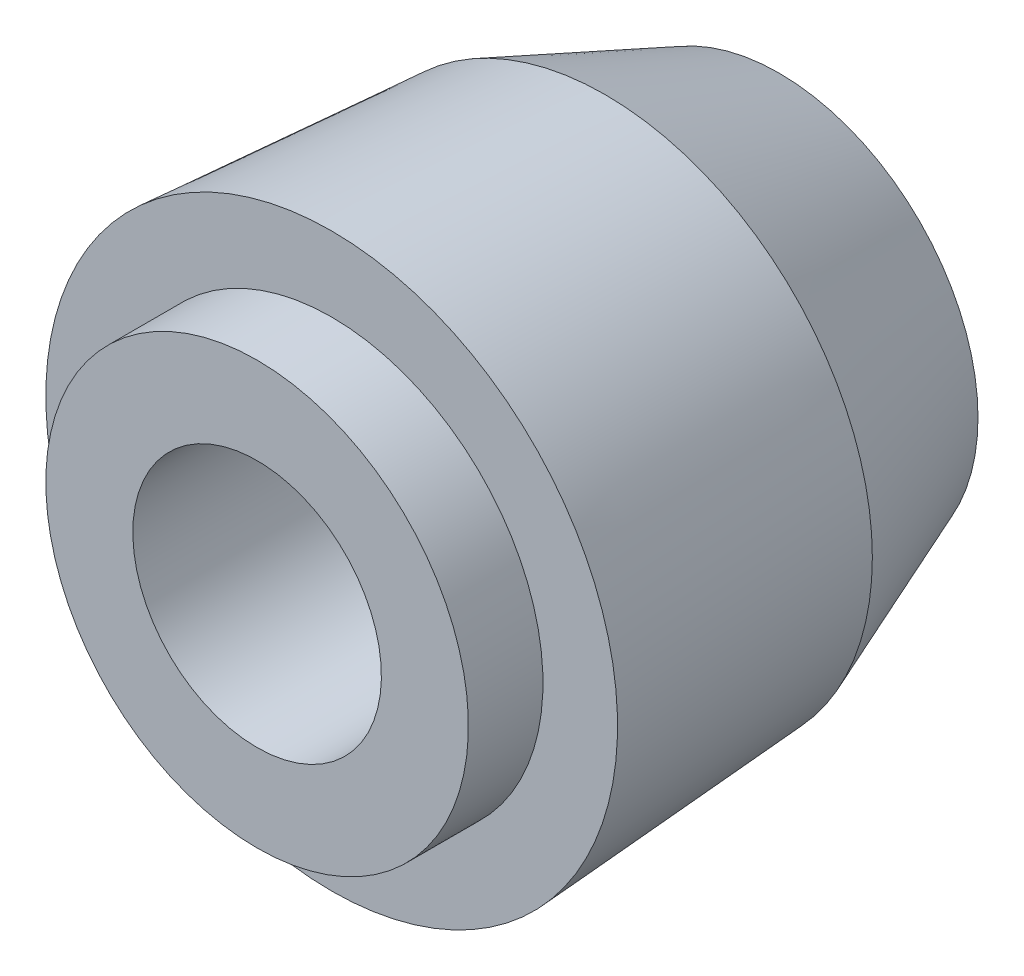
ISO-10303-21;
HEADER;
FILE_DESCRIPTION(('STEP AP214'),'2;1');
FILE_NAME('part.step','',(''),(''),'','','');
FILE_SCHEMA(('AUTOMOTIVE_DESIGN { 1 0 10303 214 1 1 1 1 }'));
ENDSEC;
DATA;
#1=APPLICATION_CONTEXT('core data for automotive mechanical design processes');
#2=APPLICATION_PROTOCOL_DEFINITION('international standard','automotive_design',2000,#1);
#3=PRODUCT_CONTEXT('',#1,'mechanical');
#4=PRODUCT('Part','Part','',(#3));
#5=PRODUCT_RELATED_PRODUCT_CATEGORY('part','',(#4));
#6=PRODUCT_DEFINITION_FORMATION('','',#4);
#7=PRODUCT_DEFINITION_CONTEXT('part definition',#1,'design');
#8=PRODUCT_DEFINITION('design','',#6,#7);
#9=PRODUCT_DEFINITION_SHAPE('','',#8);
#10=(LENGTH_UNIT() NAMED_UNIT(*) SI_UNIT(.MILLI.,.METRE.));
#11=(NAMED_UNIT(*) PLANE_ANGLE_UNIT() SI_UNIT($,.RADIAN.));
#12=(NAMED_UNIT(*) SI_UNIT($,.STERADIAN.) SOLID_ANGLE_UNIT());
#13=UNCERTAINTY_MEASURE_WITH_UNIT(LENGTH_MEASURE(1.E-05),#10,'distance_accuracy_value','');
#14=(GEOMETRIC_REPRESENTATION_CONTEXT(3) GLOBAL_UNCERTAINTY_ASSIGNED_CONTEXT((#13)) GLOBAL_UNIT_ASSIGNED_CONTEXT((#10,
#11,#12)) REPRESENTATION_CONTEXT('',''));
#15=CARTESIAN_POINT('',(0.,0.,0.));
#16=DIRECTION('',(0.,0.,1.));
#17=DIRECTION('',(1.,0.,0.));
#18=AXIS2_PLACEMENT_3D('',#15,#16,#17);
#19=CARTESIAN_POINT('',(5.,0.,21.));
#20=DIRECTION('',(0.,0.,-1.));
#21=DIRECTION('',(0.,1.,0.));
#22=AXIS2_PLACEMENT_3D('',#19,#20,#21);
#23=PLANE('',#22);
#24=CARTESIAN_POINT('',(0.,0.,21.));
#25=DIRECTION('',(0.,0.,1.));
#26=DIRECTION('',(0.,-1.,0.));
#27=AXIS2_PLACEMENT_3D('',#24,#25,#26);
#28=CIRCLE('',#27,5.0000000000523);
#29=CARTESIAN_POINT('',(0.,-5.0000000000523,21.));
#30=VERTEX_POINT('',#29);
#31=EDGE_CURVE('E39',#30,#30,#28,.T.);
#32=ORIENTED_EDGE('',*,*,#31,.F.);
#33=EDGE_LOOP('',(#32));
#34=FACE_BOUND('',#33,.T.);
#35=CARTESIAN_POINT('',(0.,0.,21.));
#36=DIRECTION('',(0.,0.,1.));
#37=DIRECTION('',(0.,-1.,0.));
#38=AXIS2_PLACEMENT_3D('',#35,#36,#37);
#39=CIRCLE('',#38,8.5);
#40=CARTESIAN_POINT('',(0.,-8.5,21.));
#41=VERTEX_POINT('',#40);
#42=EDGE_CURVE('E15',#41,#41,#39,.F.);
#43=ORIENTED_EDGE('',*,*,#42,.F.);
#44=EDGE_LOOP('',(#43));
#45=FACE_BOUND('',#44,.T.);
#46=ADVANCED_FACE('F12',(#34,#45),#23,.F.);
#47=CARTESIAN_POINT('',(8.,0.,0.));
#48=DIRECTION('',(0.,0.,1.));
#49=DIRECTION('',(0.,-1.,0.));
#50=AXIS2_PLACEMENT_3D('',#47,#48,#49);
#51=PLANE('',#50);
#52=CARTESIAN_POINT('',(0.,0.,0.));
#53=DIRECTION('',(0.,0.,1.));
#54=DIRECTION('',(-1.,0.,0.));
#55=AXIS2_PLACEMENT_3D('',#52,#53,#54);
#56=CIRCLE('',#55,8.);
#57=CARTESIAN_POINT('',(-8.,0.,0.));
#58=VERTEX_POINT('',#57);
#59=EDGE_CURVE('E30',#58,#58,#56,.T.);
#60=ORIENTED_EDGE('',*,*,#59,.F.);
#61=EDGE_LOOP('',(#60));
#62=FACE_BOUND('',#61,.T.);
#63=ADVANCED_FACE('F51',(#62),#51,.F.);
#64=CARTESIAN_POINT('',(0.,0.,0.));
#65=DIRECTION('',(0.,0.,1.));
#66=DIRECTION('',(0.,-1.,0.));
#67=AXIS2_PLACEMENT_3D('',#64,#65,#66);
#68=CYLINDRICAL_SURFACE('',#67,8.5);
#69=ORIENTED_EDGE('',*,*,#42,.T.);
#70=EDGE_LOOP('',(#69));
#71=FACE_BOUND('',#70,.T.);
#72=CARTESIAN_POINT('',(0.,0.,18.));
#73=DIRECTION('',(0.,0.,1.));
#74=DIRECTION('',(0.,-1.,0.));
#75=AXIS2_PLACEMENT_3D('',#72,#73,#74);
#76=CIRCLE('',#75,8.5);
#77=CARTESIAN_POINT('',(0.,-8.5,18.));
#78=VERTEX_POINT('',#77);
#79=EDGE_CURVE('E24',#78,#78,#76,.T.);
#80=ORIENTED_EDGE('',*,*,#79,.T.);
#81=EDGE_LOOP('',(#80));
#82=FACE_BOUND('',#81,.T.);
#83=ADVANCED_FACE('F57',(#71,#82),#68,.T.);
#84=CARTESIAN_POINT('',(0.,0.,7.));
#85=DIRECTION('',(0.,0.,1.));
#86=DIRECTION('',(-1.,0.,0.));
#87=AXIS2_PLACEMENT_3D('',#84,#85,#86);
#88=CONICAL_SURFACE('',#87,10.75,0.374333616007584);
#89=CARTESIAN_POINT('',(0.,0.,7.));
#90=DIRECTION('',(0.,0.,1.));
#91=DIRECTION('',(0.,-1.,0.));
#92=AXIS2_PLACEMENT_3D('',#89,#90,#91);
#93=CIRCLE('',#92,10.75);
#94=CARTESIAN_POINT('',(0.,-10.75,7.));
#95=VERTEX_POINT('',#94);
#96=EDGE_CURVE('E19',#95,#95,#93,.T.);
#97=ORIENTED_EDGE('',*,*,#96,.F.);
#98=EDGE_LOOP('',(#97));
#99=FACE_BOUND('',#98,.T.);
#100=ORIENTED_EDGE('',*,*,#59,.T.);
#101=EDGE_LOOP('',(#100));
#102=FACE_BOUND('',#101,.T.);
#103=ADVANCED_FACE('F68',(#99,#102),#88,.T.);
#104=CARTESIAN_POINT('',(8.5,0.,18.));
#105=DIRECTION('',(0.,0.,-1.));
#106=DIRECTION('',(0.,1.,0.));
#107=AXIS2_PLACEMENT_3D('',#104,#105,#106);
#108=PLANE('',#107);
#109=ORIENTED_EDGE('',*,*,#79,.F.);
#110=EDGE_LOOP('',(#109));
#111=FACE_BOUND('',#110,.T.);
#112=CARTESIAN_POINT('',(0.,0.,18.));
#113=DIRECTION('',(0.,0.,1.));
#114=DIRECTION('',(0.,-1.,0.));
#115=AXIS2_PLACEMENT_3D('',#112,#113,#114);
#116=CIRCLE('',#115,11.5);
#117=CARTESIAN_POINT('',(0.,-11.5,18.));
#118=VERTEX_POINT('',#117);
#119=EDGE_CURVE('E8',#118,#118,#116,.F.);
#120=ORIENTED_EDGE('',*,*,#119,.F.);
#121=EDGE_LOOP('',(#120));
#122=FACE_BOUND('',#121,.T.);
#123=ADVANCED_FACE('F63',(#111,#122),#108,.F.);
#124=CARTESIAN_POINT('',(0.,0.,18.));
#125=DIRECTION('',(0.,0.,1.));
#126=DIRECTION('',(0.,-1.,0.));
#127=AXIS2_PLACEMENT_3D('',#124,#125,#126);
#128=CONICAL_SURFACE('',#127,11.5,0.0680764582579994);
#129=ORIENTED_EDGE('',*,*,#119,.T.);
#130=EDGE_LOOP('',(#129));
#131=FACE_BOUND('',#130,.T.);
#132=ORIENTED_EDGE('',*,*,#96,.T.);
#133=EDGE_LOOP('',(#132));
#134=FACE_BOUND('',#133,.T.);
#135=ADVANCED_FACE('F60',(#131,#134),#128,.T.);
#136=CARTESIAN_POINT('',(0.,0.,13.));
#137=DIRECTION('',(0.,0.,1.));
#138=DIRECTION('',(0.,-1.,0.));
#139=AXIS2_PLACEMENT_3D('',#136,#137,#138);
#140=PLANE('',#139);
#141=CARTESIAN_POINT('',(0.,0.,13.));
#142=DIRECTION('',(0.,0.,1.));
#143=DIRECTION('',(0.,-1.,0.));
#144=AXIS2_PLACEMENT_3D('',#141,#142,#143);
#145=CIRCLE('',#144,5.0000000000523);
#146=CARTESIAN_POINT('',(0.,-5.0000000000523,13.));
#147=VERTEX_POINT('',#146);
#148=EDGE_CURVE('E35',#147,#147,#145,.T.);
#149=ORIENTED_EDGE('',*,*,#148,.T.);
#150=EDGE_LOOP('',(#149));
#151=FACE_BOUND('',#150,.T.);
#152=ADVANCED_FACE('F52',(#151),#140,.T.);
#153=CARTESIAN_POINT('',(0.,0.,13.));
#154=DIRECTION('',(0.,0.,1.));
#155=DIRECTION('',(0.,-1.,0.));
#156=AXIS2_PLACEMENT_3D('',#153,#154,#155);
#157=CYLINDRICAL_SURFACE('',#156,5.0000000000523);
#158=ORIENTED_EDGE('',*,*,#148,.F.);
#159=EDGE_LOOP('',(#158));
#160=FACE_BOUND('',#159,.T.);
#161=ORIENTED_EDGE('',*,*,#31,.T.);
#162=EDGE_LOOP('',(#161));
#163=FACE_BOUND('',#162,.T.);
#164=ADVANCED_FACE('F47',(#160,#163),#157,.F.);
#165=CLOSED_SHELL('',(#46,#63,#83,#103,#123,#135,#152,#164));
#166=MANIFOLD_SOLID_BREP('B1',#165);
#167=ADVANCED_BREP_SHAPE_REPRESENTATION('',(#18,#166),#14);
#168=SHAPE_DEFINITION_REPRESENTATION(#9,#167);
ENDSEC;
END-ISO-10303-21;
